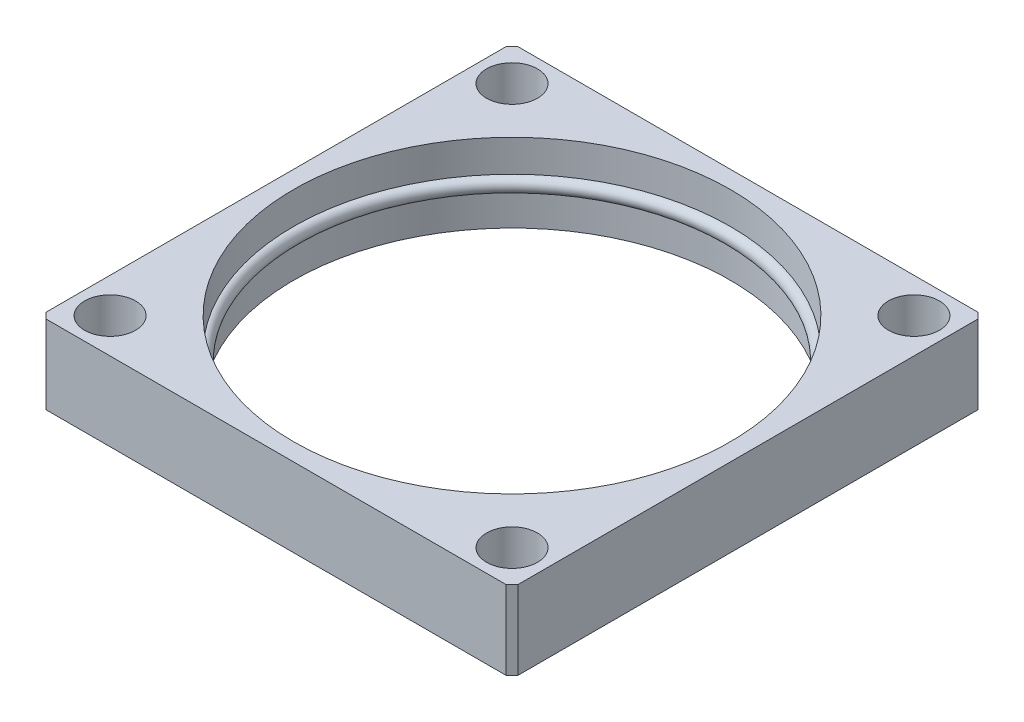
ISO-10303-21;
HEADER;
FILE_DESCRIPTION(('STEP AP214'),'2;1');
FILE_NAME('part.step','',(''),(''),'','','');
FILE_SCHEMA(('AUTOMOTIVE_DESIGN { 1 0 10303 214 1 1 1 1 }'));
ENDSEC;
DATA;
#1=APPLICATION_CONTEXT('core data for automotive mechanical design processes');
#2=APPLICATION_PROTOCOL_DEFINITION('international standard','automotive_design',2000,#1);
#3=PRODUCT_CONTEXT('',#1,'mechanical');
#4=PRODUCT('Part','Part','',(#3));
#5=PRODUCT_RELATED_PRODUCT_CATEGORY('part','',(#4));
#6=PRODUCT_DEFINITION_FORMATION('','',#4);
#7=PRODUCT_DEFINITION_CONTEXT('part definition',#1,'design');
#8=PRODUCT_DEFINITION('design','',#6,#7);
#9=PRODUCT_DEFINITION_SHAPE('','',#8);
#10=(LENGTH_UNIT() NAMED_UNIT(*) SI_UNIT(.MILLI.,.METRE.));
#11=(NAMED_UNIT(*) PLANE_ANGLE_UNIT() SI_UNIT($,.RADIAN.));
#12=(NAMED_UNIT(*) SI_UNIT($,.STERADIAN.) SOLID_ANGLE_UNIT());
#13=UNCERTAINTY_MEASURE_WITH_UNIT(LENGTH_MEASURE(1.E-05),#10,'distance_accuracy_value','');
#14=(GEOMETRIC_REPRESENTATION_CONTEXT(3) GLOBAL_UNCERTAINTY_ASSIGNED_CONTEXT((#13)) GLOBAL_UNIT_ASSIGNED_CONTEXT((#10,
#11,#12)) REPRESENTATION_CONTEXT('',''));
#15=CARTESIAN_POINT('',(0.,0.,0.));
#16=DIRECTION('',(0.,0.,1.));
#17=DIRECTION('',(1.,0.,0.));
#18=AXIS2_PLACEMENT_3D('',#15,#16,#17);
#19=CARTESIAN_POINT('',(0.,13.5,0.));
#20=DIRECTION('',(0.,-1.,0.));
#21=DIRECTION('',(0.,0.,-1.));
#22=AXIS2_PLACEMENT_3D('',#19,#20,#21);
#23=CYLINDRICAL_SURFACE('',#22,75.);
#24=CARTESIAN_POINT('',(0.,-13.5,0.));
#25=DIRECTION('',(0.,1.,0.));
#26=DIRECTION('',(0.,0.,1.));
#27=AXIS2_PLACEMENT_3D('',#24,#25,#26);
#28=CIRCLE('',#27,75.);
#29=CARTESIAN_POINT('',(0.,-13.5,75.));
#30=VERTEX_POINT('',#29);
#31=EDGE_CURVE('E192',#30,#30,#28,.T.);
#32=ORIENTED_EDGE('',*,*,#31,.F.);
#33=EDGE_LOOP('',(#32));
#34=FACE_BOUND('',#33,.T.);
#35=CARTESIAN_POINT('',(0.,-2.50000000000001,0.));
#36=DIRECTION('',(0.,1.,0.));
#37=DIRECTION('',(0.,0.,1.));
#38=AXIS2_PLACEMENT_3D('',#35,#36,#37);
#39=CIRCLE('',#38,75.);
#40=CARTESIAN_POINT('',(0.,-2.50000000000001,75.));
#41=VERTEX_POINT('',#40);
#42=EDGE_CURVE('E38',#41,#41,#39,.T.);
#43=ORIENTED_EDGE('',*,*,#42,.T.);
#44=EDGE_LOOP('',(#43));
#45=FACE_BOUND('',#44,.T.);
#46=ADVANCED_FACE('F34',(#34,#45),#23,.F.);
#47=CARTESIAN_POINT('',(0.,13.5,0.));
#48=DIRECTION('',(0.,1.,0.));
#49=DIRECTION('',(0.,0.,1.));
#50=AXIS2_PLACEMENT_3D('',#47,#48,#49);
#51=CIRCLE('',#50,75.);
#52=CARTESIAN_POINT('',(0.,13.5,75.));
#53=VERTEX_POINT('',#52);
#54=EDGE_CURVE('E138',#53,#53,#51,.T.);
#55=ORIENTED_EDGE('',*,*,#54,.T.);
#56=EDGE_LOOP('',(#55));
#57=FACE_BOUND('',#56,.T.);
#58=CARTESIAN_POINT('',(0.,2.50000000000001,0.));
#59=DIRECTION('',(0.,-1.,0.));
#60=DIRECTION('',(0.,0.,-1.));
#61=AXIS2_PLACEMENT_3D('',#58,#59,#60);
#62=CIRCLE('',#61,75.);
#63=CARTESIAN_POINT('',(0.,2.50000000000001,-75.));
#64=VERTEX_POINT('',#63);
#65=EDGE_CURVE('E160',#64,#64,#62,.T.);
#66=ORIENTED_EDGE('',*,*,#65,.T.);
#67=EDGE_LOOP('',(#66));
#68=FACE_BOUND('',#67,.T.);
#69=ADVANCED_FACE('F236',(#57,#68),#23,.F.);
#70=CARTESIAN_POINT('',(0.,13.5,0.));
#71=DIRECTION('',(0.,1.,0.));
#72=DIRECTION('',(0.,0.,1.));
#73=AXIS2_PLACEMENT_3D('',#70,#71,#72);
#74=PLANE('',#73);
#75=CARTESIAN_POINT('',(69.,13.5,69.));
#76=DIRECTION('',(0.,1.,0.));
#77=DIRECTION('',(0.,0.,1.));
#78=AXIS2_PLACEMENT_3D('',#75,#76,#77);
#79=CIRCLE('',#78,8.75000000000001);
#80=CARTESIAN_POINT('',(69.,13.5,77.75));
#81=VERTEX_POINT('',#80);
#82=EDGE_CURVE('E177',#81,#81,#79,.T.);
#83=ORIENTED_EDGE('',*,*,#82,.F.);
#84=EDGE_LOOP('',(#83));
#85=FACE_BOUND('',#84,.T.);
#86=CARTESIAN_POINT('',(69.0000000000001,13.5,-69.));
#87=DIRECTION('',(0.,1.,0.));
#88=DIRECTION('',(0.,0.,1.));
#89=AXIS2_PLACEMENT_3D('',#86,#87,#88);
#90=CIRCLE('',#89,8.75000000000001);
#91=CARTESIAN_POINT('',(69.0000000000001,13.5,-60.25));
#92=VERTEX_POINT('',#91);
#93=EDGE_CURVE('E189',#92,#92,#90,.T.);
#94=ORIENTED_EDGE('',*,*,#93,.F.);
#95=EDGE_LOOP('',(#94));
#96=FACE_BOUND('',#95,.T.);
#97=DIRECTION('',(-1.,0.,0.));
#98=VECTOR('',#97,1.);
#99=CARTESIAN_POINT('',(-79.,13.5,-81.));
#100=LINE('',#99,#98);
#101=CARTESIAN_POINT('',(79.,13.5,-81.));
#102=VERTEX_POINT('',#101);
#103=CARTESIAN_POINT('',(-79.,13.5,-81.));
#104=VERTEX_POINT('',#103);
#105=EDGE_CURVE('E149',#102,#104,#100,.T.);
#106=ORIENTED_EDGE('',*,*,#105,.T.);
#107=DIRECTION('',(-0.707106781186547,0.,0.707106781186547));
#108=VECTOR('',#107,1.);
#109=CARTESIAN_POINT('',(-81.,13.5,-79.));
#110=LINE('',#109,#108);
#111=CARTESIAN_POINT('',(-81.,13.5,-79.));
#112=VERTEX_POINT('',#111);
#113=EDGE_CURVE('E96',#104,#112,#110,.T.);
#114=ORIENTED_EDGE('',*,*,#113,.T.);
#115=DIRECTION('',(0.,0.,1.));
#116=VECTOR('',#115,1.);
#117=CARTESIAN_POINT('',(-81.,13.5,79.));
#118=LINE('',#117,#116);
#119=CARTESIAN_POINT('',(-81.,13.5,79.));
#120=VERTEX_POINT('',#119);
#121=EDGE_CURVE('E201',#112,#120,#118,.T.);
#122=ORIENTED_EDGE('',*,*,#121,.T.);
#123=DIRECTION('',(0.707106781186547,0.,0.707106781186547));
#124=VECTOR('',#123,1.);
#125=CARTESIAN_POINT('',(-79.,13.5,81.));
#126=LINE('',#125,#124);
#127=CARTESIAN_POINT('',(-79.,13.5,81.));
#128=VERTEX_POINT('',#127);
#129=EDGE_CURVE('E203',#120,#128,#126,.T.);
#130=ORIENTED_EDGE('',*,*,#129,.T.);
#131=DIRECTION('',(1.,0.,0.));
#132=VECTOR('',#131,1.);
#133=CARTESIAN_POINT('',(-79.,13.5,81.));
#134=LINE('',#133,#132);
#135=CARTESIAN_POINT('',(79.,13.5,81.));
#136=VERTEX_POINT('',#135);
#137=EDGE_CURVE('E116',#128,#136,#134,.T.);
#138=ORIENTED_EDGE('',*,*,#137,.T.);
#139=DIRECTION('',(0.707106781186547,0.,-0.707106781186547));
#140=VECTOR('',#139,1.);
#141=CARTESIAN_POINT('',(79.,13.5,81.));
#142=LINE('',#141,#140);
#143=CARTESIAN_POINT('',(81.,13.5,79.));
#144=VERTEX_POINT('',#143);
#145=EDGE_CURVE('E109',#136,#144,#142,.T.);
#146=ORIENTED_EDGE('',*,*,#145,.T.);
#147=DIRECTION('',(0.,0.,-1.));
#148=VECTOR('',#147,1.);
#149=CARTESIAN_POINT('',(81.,13.5,79.));
#150=LINE('',#149,#148);
#151=CARTESIAN_POINT('',(81.,13.5,-79.));
#152=VERTEX_POINT('',#151);
#153=EDGE_CURVE('E114',#144,#152,#150,.T.);
#154=ORIENTED_EDGE('',*,*,#153,.T.);
#155=DIRECTION('',(-0.707106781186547,0.,-0.707106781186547));
#156=VECTOR('',#155,1.);
#157=CARTESIAN_POINT('',(79.,13.5,-81.));
#158=LINE('',#157,#156);
#159=EDGE_CURVE('E53',#152,#102,#158,.T.);
#160=ORIENTED_EDGE('',*,*,#159,.T.);
#161=EDGE_LOOP('',(#106,#114,#122,#130,#138,#146,#154,#160));
#162=FACE_BOUND('',#161,.T.);
#163=ORIENTED_EDGE('',*,*,#54,.F.);
#164=EDGE_LOOP('',(#163));
#165=FACE_BOUND('',#164,.T.);
#166=CARTESIAN_POINT('',(-69.,13.5,-69.));
#167=DIRECTION('',(0.,1.,0.));
#168=DIRECTION('',(0.,0.,1.));
#169=AXIS2_PLACEMENT_3D('',#166,#167,#168);
#170=CIRCLE('',#169,8.75000000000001);
#171=CARTESIAN_POINT('',(-69.,13.5,-60.25));
#172=VERTEX_POINT('',#171);
#173=EDGE_CURVE('E183',#172,#172,#170,.T.);
#174=ORIENTED_EDGE('',*,*,#173,.F.);
#175=EDGE_LOOP('',(#174));
#176=FACE_BOUND('',#175,.T.);
#177=CARTESIAN_POINT('',(-69.,13.5,69.));
#178=DIRECTION('',(0.,1.,0.));
#179=DIRECTION('',(0.,0.,1.));
#180=AXIS2_PLACEMENT_3D('',#177,#178,#179);
#181=CIRCLE('',#180,8.75000000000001);
#182=CARTESIAN_POINT('',(-69.,13.5,77.75));
#183=VERTEX_POINT('',#182);
#184=EDGE_CURVE('E169',#183,#183,#181,.T.);
#185=ORIENTED_EDGE('',*,*,#184,.F.);
#186=EDGE_LOOP('',(#185));
#187=FACE_BOUND('',#186,.T.);
#188=ADVANCED_FACE('F111',(#85,#96,#162,#165,#176,#187),#74,.T.);
#189=CARTESIAN_POINT('',(0.,-13.5,0.));
#190=DIRECTION('',(0.,1.,0.));
#191=DIRECTION('',(0.,0.,1.));
#192=AXIS2_PLACEMENT_3D('',#189,#190,#191);
#193=PLANE('',#192);
#194=DIRECTION('',(-1.,0.,0.));
#195=VECTOR('',#194,1.);
#196=CARTESIAN_POINT('',(-79.,-13.5,-81.));
#197=LINE('',#196,#195);
#198=CARTESIAN_POINT('',(79.,-13.5,-81.));
#199=VERTEX_POINT('',#198);
#200=CARTESIAN_POINT('',(-79.,-13.5,-81.));
#201=VERTEX_POINT('',#200);
#202=EDGE_CURVE('E134',#199,#201,#197,.T.);
#203=ORIENTED_EDGE('',*,*,#202,.F.);
#204=DIRECTION('',(-0.707106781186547,0.,-0.707106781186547));
#205=VECTOR('',#204,1.);
#206=CARTESIAN_POINT('',(79.,-13.5,-81.));
#207=LINE('',#206,#205);
#208=CARTESIAN_POINT('',(81.,-13.5,-79.));
#209=VERTEX_POINT('',#208);
#210=EDGE_CURVE('E88',#209,#199,#207,.T.);
#211=ORIENTED_EDGE('',*,*,#210,.F.);
#212=DIRECTION('',(0.,0.,-1.));
#213=VECTOR('',#212,1.);
#214=CARTESIAN_POINT('',(81.,-13.5,79.));
#215=LINE('',#214,#213);
#216=CARTESIAN_POINT('',(81.,-13.5,79.));
#217=VERTEX_POINT('',#216);
#218=EDGE_CURVE('E82',#217,#209,#215,.T.);
#219=ORIENTED_EDGE('',*,*,#218,.F.);
#220=DIRECTION('',(0.707106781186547,0.,-0.707106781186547));
#221=VECTOR('',#220,1.);
#222=CARTESIAN_POINT('',(79.,-13.5,81.));
#223=LINE('',#222,#221);
#224=CARTESIAN_POINT('',(79.,-13.5,81.));
#225=VERTEX_POINT('',#224);
#226=EDGE_CURVE('E124',#225,#217,#223,.T.);
#227=ORIENTED_EDGE('',*,*,#226,.F.);
#228=DIRECTION('',(1.,0.,0.));
#229=VECTOR('',#228,1.);
#230=CARTESIAN_POINT('',(-79.,-13.5,81.));
#231=LINE('',#230,#229);
#232=CARTESIAN_POINT('',(-79.,-13.5,81.));
#233=VERTEX_POINT('',#232);
#234=EDGE_CURVE('E144',#233,#225,#231,.T.);
#235=ORIENTED_EDGE('',*,*,#234,.F.);
#236=DIRECTION('',(0.707106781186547,0.,0.707106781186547));
#237=VECTOR('',#236,1.);
#238=CARTESIAN_POINT('',(-79.,-13.5,81.));
#239=LINE('',#238,#237);
#240=CARTESIAN_POINT('',(-81.,-13.5,79.));
#241=VERTEX_POINT('',#240);
#242=EDGE_CURVE('E142',#241,#233,#239,.T.);
#243=ORIENTED_EDGE('',*,*,#242,.F.);
#244=DIRECTION('',(0.,0.,1.));
#245=VECTOR('',#244,1.);
#246=CARTESIAN_POINT('',(-81.,-13.5,79.));
#247=LINE('',#246,#245);
#248=CARTESIAN_POINT('',(-81.,-13.5,-79.));
#249=VERTEX_POINT('',#248);
#250=EDGE_CURVE('E140',#249,#241,#247,.T.);
#251=ORIENTED_EDGE('',*,*,#250,.F.);
#252=DIRECTION('',(-0.707106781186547,0.,0.707106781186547));
#253=VECTOR('',#252,1.);
#254=CARTESIAN_POINT('',(-81.,-13.5,-79.));
#255=LINE('',#254,#253);
#256=EDGE_CURVE('E137',#201,#249,#255,.T.);
#257=ORIENTED_EDGE('',*,*,#256,.F.);
#258=EDGE_LOOP('',(#203,#211,#219,#227,#235,#243,#251,#257));
#259=FACE_BOUND('',#258,.T.);
#260=ORIENTED_EDGE('',*,*,#31,.T.);
#261=EDGE_LOOP('',(#260));
#262=FACE_BOUND('',#261,.T.);
#263=CARTESIAN_POINT('',(69.0000000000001,-13.5,-69.));
#264=DIRECTION('',(0.,1.,0.));
#265=DIRECTION('',(0.,0.,1.));
#266=AXIS2_PLACEMENT_3D('',#263,#264,#265);
#267=CIRCLE('',#266,8.75000000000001);
#268=CARTESIAN_POINT('',(69.0000000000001,-13.5,-60.25));
#269=VERTEX_POINT('',#268);
#270=EDGE_CURVE('E186',#269,#269,#267,.T.);
#271=ORIENTED_EDGE('',*,*,#270,.T.);
#272=EDGE_LOOP('',(#271));
#273=FACE_BOUND('',#272,.T.);
#274=CARTESIAN_POINT('',(-69.,-13.5,-69.));
#275=DIRECTION('',(0.,1.,0.));
#276=DIRECTION('',(0.,0.,1.));
#277=AXIS2_PLACEMENT_3D('',#274,#275,#276);
#278=CIRCLE('',#277,8.75000000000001);
#279=CARTESIAN_POINT('',(-69.,-13.5,-60.25));
#280=VERTEX_POINT('',#279);
#281=EDGE_CURVE('E180',#280,#280,#278,.T.);
#282=ORIENTED_EDGE('',*,*,#281,.T.);
#283=EDGE_LOOP('',(#282));
#284=FACE_BOUND('',#283,.T.);
#285=CARTESIAN_POINT('',(69.,-13.5,69.));
#286=DIRECTION('',(0.,1.,0.));
#287=DIRECTION('',(0.,0.,1.));
#288=AXIS2_PLACEMENT_3D('',#285,#286,#287);
#289=CIRCLE('',#288,8.75000000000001);
#290=CARTESIAN_POINT('',(69.,-13.5,77.75));
#291=VERTEX_POINT('',#290);
#292=EDGE_CURVE('E174',#291,#291,#289,.T.);
#293=ORIENTED_EDGE('',*,*,#292,.T.);
#294=EDGE_LOOP('',(#293));
#295=FACE_BOUND('',#294,.T.);
#296=CARTESIAN_POINT('',(-69.,-13.5,69.));
#297=DIRECTION('',(0.,1.,0.));
#298=DIRECTION('',(0.,0.,1.));
#299=AXIS2_PLACEMENT_3D('',#296,#297,#298);
#300=CIRCLE('',#299,8.75000000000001);
#301=CARTESIAN_POINT('',(-69.,-13.5,77.75));
#302=VERTEX_POINT('',#301);
#303=EDGE_CURVE('E165',#302,#302,#300,.T.);
#304=ORIENTED_EDGE('',*,*,#303,.T.);
#305=EDGE_LOOP('',(#304));
#306=FACE_BOUND('',#305,.T.);
#307=ADVANCED_FACE('F216',(#259,#262,#273,#284,#295,#306),#193,.F.);
#308=CARTESIAN_POINT('',(-79.,13.5,-81.));
#309=DIRECTION('',(0.,0.,1.));
#310=DIRECTION('',(1.,0.,0.));
#311=AXIS2_PLACEMENT_3D('',#308,#309,#310);
#312=PLANE('',#311);
#313=ORIENTED_EDGE('',*,*,#202,.T.);
#314=DIRECTION('',(0.,-1.,0.));
#315=VECTOR('',#314,1.);
#316=CARTESIAN_POINT('',(-79.,13.5,-81.));
#317=LINE('',#316,#315);
#318=EDGE_CURVE('E11',#104,#201,#317,.T.);
#319=ORIENTED_EDGE('',*,*,#318,.F.);
#320=ORIENTED_EDGE('',*,*,#105,.F.);
#321=DIRECTION('',(0.,-1.,0.));
#322=VECTOR('',#321,1.);
#323=CARTESIAN_POINT('',(79.,13.5,-81.));
#324=LINE('',#323,#322);
#325=EDGE_CURVE('E130',#102,#199,#324,.T.);
#326=ORIENTED_EDGE('',*,*,#325,.T.);
#327=EDGE_LOOP('',(#313,#319,#320,#326));
#328=FACE_BOUND('',#327,.T.);
#329=ADVANCED_FACE('F36',(#328),#312,.F.);
#330=CARTESIAN_POINT('',(-81.,13.5,-79.));
#331=DIRECTION('',(0.707106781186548,0.,0.707106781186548));
#332=DIRECTION('',(0.707106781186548,0.,-0.707106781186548));
#333=AXIS2_PLACEMENT_3D('',#330,#331,#332);
#334=PLANE('',#333);
#335=ORIENTED_EDGE('',*,*,#256,.T.);
#336=DIRECTION('',(0.,-1.,0.));
#337=VECTOR('',#336,1.);
#338=CARTESIAN_POINT('',(-81.,13.5,-79.));
#339=LINE('',#338,#337);
#340=EDGE_CURVE('E44',#112,#249,#339,.T.);
#341=ORIENTED_EDGE('',*,*,#340,.F.);
#342=ORIENTED_EDGE('',*,*,#113,.F.);
#343=ORIENTED_EDGE('',*,*,#318,.T.);
#344=EDGE_LOOP('',(#335,#341,#342,#343));
#345=FACE_BOUND('',#344,.T.);
#346=ADVANCED_FACE('F252',(#345),#334,.F.);
#347=CARTESIAN_POINT('',(-81.,13.5,79.));
#348=DIRECTION('',(1.,0.,0.));
#349=DIRECTION('',(0.,0.,-1.));
#350=AXIS2_PLACEMENT_3D('',#347,#348,#349);
#351=PLANE('',#350);
#352=ORIENTED_EDGE('',*,*,#250,.T.);
#353=DIRECTION('',(0.,-1.,0.));
#354=VECTOR('',#353,1.);
#355=CARTESIAN_POINT('',(-81.,13.5,79.));
#356=LINE('',#355,#354);
#357=EDGE_CURVE('E156',#120,#241,#356,.T.);
#358=ORIENTED_EDGE('',*,*,#357,.F.);
#359=ORIENTED_EDGE('',*,*,#121,.F.);
#360=ORIENTED_EDGE('',*,*,#340,.T.);
#361=EDGE_LOOP('',(#352,#358,#359,#360));
#362=FACE_BOUND('',#361,.T.);
#363=ADVANCED_FACE('F256',(#362),#351,.F.);
#364=CARTESIAN_POINT('',(-79.,13.5,81.));
#365=DIRECTION('',(0.707106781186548,0.,-0.707106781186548));
#366=DIRECTION('',(-0.707106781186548,0.,-0.707106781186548));
#367=AXIS2_PLACEMENT_3D('',#364,#365,#366);
#368=PLANE('',#367);
#369=ORIENTED_EDGE('',*,*,#242,.T.);
#370=DIRECTION('',(0.,-1.,0.));
#371=VECTOR('',#370,1.);
#372=CARTESIAN_POINT('',(-79.,13.5,81.));
#373=LINE('',#372,#371);
#374=EDGE_CURVE('E153',#128,#233,#373,.T.);
#375=ORIENTED_EDGE('',*,*,#374,.F.);
#376=ORIENTED_EDGE('',*,*,#129,.F.);
#377=ORIENTED_EDGE('',*,*,#357,.T.);
#378=EDGE_LOOP('',(#369,#375,#376,#377));
#379=FACE_BOUND('',#378,.T.);
#380=ADVANCED_FACE('F209',(#379),#368,.F.);
#381=CARTESIAN_POINT('',(-79.,13.5,81.));
#382=DIRECTION('',(0.,0.,-1.));
#383=DIRECTION('',(-1.,0.,0.));
#384=AXIS2_PLACEMENT_3D('',#381,#382,#383);
#385=PLANE('',#384);
#386=ORIENTED_EDGE('',*,*,#234,.T.);
#387=DIRECTION('',(0.,-1.,0.));
#388=VECTOR('',#387,1.);
#389=CARTESIAN_POINT('',(79.,13.5,81.));
#390=LINE('',#389,#388);
#391=EDGE_CURVE('E125',#136,#225,#390,.T.);
#392=ORIENTED_EDGE('',*,*,#391,.F.);
#393=ORIENTED_EDGE('',*,*,#137,.F.);
#394=ORIENTED_EDGE('',*,*,#374,.T.);
#395=EDGE_LOOP('',(#386,#392,#393,#394));
#396=FACE_BOUND('',#395,.T.);
#397=ADVANCED_FACE('F213',(#396),#385,.F.);
#398=CARTESIAN_POINT('',(79.,13.5,81.));
#399=DIRECTION('',(-0.707106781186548,0.,-0.707106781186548));
#400=DIRECTION('',(-0.707106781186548,0.,0.707106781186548));
#401=AXIS2_PLACEMENT_3D('',#398,#399,#400);
#402=PLANE('',#401);
#403=ORIENTED_EDGE('',*,*,#226,.T.);
#404=DIRECTION('',(0.,-1.,0.));
#405=VECTOR('',#404,1.);
#406=CARTESIAN_POINT('',(81.,13.5,79.));
#407=LINE('',#406,#405);
#408=EDGE_CURVE('E121',#144,#217,#407,.T.);
#409=ORIENTED_EDGE('',*,*,#408,.F.);
#410=ORIENTED_EDGE('',*,*,#145,.F.);
#411=ORIENTED_EDGE('',*,*,#391,.T.);
#412=EDGE_LOOP('',(#403,#409,#410,#411));
#413=FACE_BOUND('',#412,.T.);
#414=ADVANCED_FACE('F122',(#413),#402,.F.);
#415=CARTESIAN_POINT('',(81.,13.5,79.));
#416=DIRECTION('',(-1.,0.,0.));
#417=DIRECTION('',(0.,0.,1.));
#418=AXIS2_PLACEMENT_3D('',#415,#416,#417);
#419=PLANE('',#418);
#420=ORIENTED_EDGE('',*,*,#218,.T.);
#421=DIRECTION('',(0.,-1.,0.));
#422=VECTOR('',#421,1.);
#423=CARTESIAN_POINT('',(81.,13.5,-79.));
#424=LINE('',#423,#422);
#425=EDGE_CURVE('E126',#152,#209,#424,.T.);
#426=ORIENTED_EDGE('',*,*,#425,.F.);
#427=ORIENTED_EDGE('',*,*,#153,.F.);
#428=ORIENTED_EDGE('',*,*,#408,.T.);
#429=EDGE_LOOP('',(#420,#426,#427,#428));
#430=FACE_BOUND('',#429,.T.);
#431=ADVANCED_FACE('F128',(#430),#419,.F.);
#432=CARTESIAN_POINT('',(79.,13.5,-81.));
#433=DIRECTION('',(-0.707106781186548,0.,0.707106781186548));
#434=DIRECTION('',(0.707106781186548,0.,0.707106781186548));
#435=AXIS2_PLACEMENT_3D('',#432,#433,#434);
#436=PLANE('',#435);
#437=ORIENTED_EDGE('',*,*,#210,.T.);
#438=ORIENTED_EDGE('',*,*,#325,.F.);
#439=ORIENTED_EDGE('',*,*,#159,.F.);
#440=ORIENTED_EDGE('',*,*,#425,.T.);
#441=EDGE_LOOP('',(#437,#438,#439,#440));
#442=FACE_BOUND('',#441,.T.);
#443=ADVANCED_FACE('F222',(#442),#436,.F.);
#444=CARTESIAN_POINT('',(69.0000000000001,13.5,-69.));
#445=DIRECTION('',(0.,-1.,0.));
#446=DIRECTION('',(0.,0.,-1.));
#447=AXIS2_PLACEMENT_3D('',#444,#445,#446);
#448=CYLINDRICAL_SURFACE('',#447,8.75000000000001);
#449=ORIENTED_EDGE('',*,*,#93,.T.);
#450=EDGE_LOOP('',(#449));
#451=FACE_BOUND('',#450,.T.);
#452=ORIENTED_EDGE('',*,*,#270,.F.);
#453=EDGE_LOOP('',(#452));
#454=FACE_BOUND('',#453,.T.);
#455=ADVANCED_FACE('F224',(#451,#454),#448,.F.);
#456=CARTESIAN_POINT('',(-69.,13.5,-69.));
#457=DIRECTION('',(0.,-1.,0.));
#458=DIRECTION('',(0.,0.,-1.));
#459=AXIS2_PLACEMENT_3D('',#456,#457,#458);
#460=CYLINDRICAL_SURFACE('',#459,8.75000000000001);
#461=ORIENTED_EDGE('',*,*,#173,.T.);
#462=EDGE_LOOP('',(#461));
#463=FACE_BOUND('',#462,.T.);
#464=ORIENTED_EDGE('',*,*,#281,.F.);
#465=EDGE_LOOP('',(#464));
#466=FACE_BOUND('',#465,.T.);
#467=ADVANCED_FACE('F230',(#463,#466),#460,.F.);
#468=CARTESIAN_POINT('',(69.,13.5,69.));
#469=DIRECTION('',(0.,-1.,0.));
#470=DIRECTION('',(0.,0.,-1.));
#471=AXIS2_PLACEMENT_3D('',#468,#469,#470);
#472=CYLINDRICAL_SURFACE('',#471,8.75000000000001);
#473=ORIENTED_EDGE('',*,*,#82,.T.);
#474=EDGE_LOOP('',(#473));
#475=FACE_BOUND('',#474,.T.);
#476=ORIENTED_EDGE('',*,*,#292,.F.);
#477=EDGE_LOOP('',(#476));
#478=FACE_BOUND('',#477,.T.);
#479=ADVANCED_FACE('F295',(#475,#478),#472,.F.);
#480=CARTESIAN_POINT('',(-69.,13.5,69.));
#481=DIRECTION('',(0.,-1.,0.));
#482=DIRECTION('',(0.,0.,-1.));
#483=AXIS2_PLACEMENT_3D('',#480,#481,#482);
#484=CYLINDRICAL_SURFACE('',#483,8.75000000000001);
#485=ORIENTED_EDGE('',*,*,#184,.T.);
#486=EDGE_LOOP('',(#485));
#487=FACE_BOUND('',#486,.T.);
#488=ORIENTED_EDGE('',*,*,#303,.F.);
#489=EDGE_LOOP('',(#488));
#490=FACE_BOUND('',#489,.T.);
#491=ADVANCED_FACE('F304',(#487,#490),#484,.F.);
#492=CARTESIAN_POINT('',(0.,0.,0.));
#493=DIRECTION('',(0.,-1.,0.));
#494=DIRECTION('',(0.,0.,-1.));
#495=AXIS2_PLACEMENT_3D('',#492,#493,#494);
#496=TOROIDAL_SURFACE('',#495,75.,2.50000000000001);
#497=ORIENTED_EDGE('',*,*,#65,.F.);
#498=EDGE_LOOP('',(#497));
#499=FACE_BOUND('',#498,.T.);
#500=ORIENTED_EDGE('',*,*,#42,.F.);
#501=EDGE_LOOP('',(#500));
#502=FACE_BOUND('',#501,.T.);
#503=ADVANCED_FACE('F313',(#499,#502),#496,.T.);
#504=CLOSED_SHELL('',(#46,#69,#188,#307,#329,#346,#363,#380,#397,#414,#431,#443,#455,#467,#479,
#491,#503));
#505=MANIFOLD_SOLID_BREP('B2',#504);
#506=ADVANCED_BREP_SHAPE_REPRESENTATION('',(#18,#505),#14);
#507=SHAPE_DEFINITION_REPRESENTATION(#9,#506);
ENDSEC;
END-ISO-10303-21;
